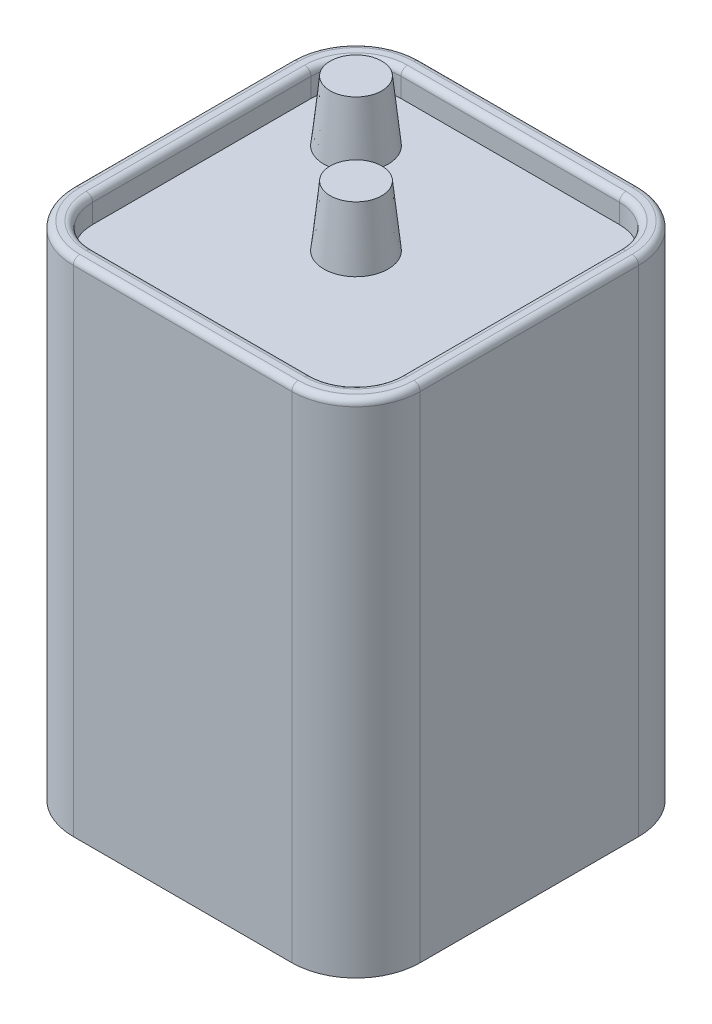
from build123d import *

# Parameters (mm, degrees)
SKETCH3_W                 = 68.58
SKETCH3_H                 = 68.58
BASE_EXTRUDE_DEPTH        = 99.06
SIDE_FILLETS_R            = 12.7
TOP_CUT_DEPTH             = 5.08
TOP_FACE_FILLET_R         = 1.27
SKETCH_TERMINALS_R        = 6.35
TERMINALS_DEPTH           = 11.938
TERMINALS_DRAFT           = 6
TERMINALS_PROFILE_2_DEPTH = 11.938
TERMINALS_PROFILE_2_DRAFT = 6


with BuildPart() as part:
    # Sketch3 → Base Extrude (new body)
    with BuildSketch(Plane(origin=(0, 0, 0), x_dir=(1, 0, 0), z_dir=(0, 1, 0))):
        Rectangle(SKETCH3_W, SKETCH3_H)
    extrude(amount=BASE_EXTRUDE_DEPTH)

    # Side Fillets
    side_fillets_edges = [part.edges().sort_by_distance(p)[0] for p in [
        (34.29, 49.53, 34.29),
        (-34.29, 49.53, 34.29),
        (-34.29, 49.53, -34.29),
        (34.29, 49.53, -34.29),
    ]]
    fillet(side_fillets_edges, radius=SIDE_FILLETS_R)

    # Sketch4 → Top Cut (cut)
    with BuildSketch(Plane(origin=(0, 99.06, 0), x_dir=(1, 0, 0), z_dir=(0, 1, 0))):
        with BuildLine():
            Line((21.59, 30.48), (-21.59, 30.48))
            ThreePointArc((-21.59, 30.48), (-27.876179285, 27.876179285), (-30.48, 21.59))
            Line((-30.48, 21.59), (-30.48, -21.59))
            ThreePointArc((-30.48, -21.59), (-27.876179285, -27.876179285), (-21.59, -30.48))
            Line((-21.59, -30.48), (21.59, -30.48))
            ThreePointArc((21.59, -30.48), (27.876179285, -27.876179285), (30.48, -21.59))
            Line((30.48, -21.59), (30.48, 21.59))
            ThreePointArc((30.48, 21.59), (27.876179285, 27.876179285), (21.59, 30.48))
        make_face()
    extrude(amount=-TOP_CUT_DEPTH, mode=Mode.SUBTRACT)

    # Top Face Fillet
    top_face_fillet_edges = [part.edges().sort_by_distance(p)[0] for p in [
        (-34.29, 99.06, 0),
        (0, 99.06, -34.29),
        (34.29, 99.06, 0),
        (0, 99.06, 34.29),
        (-30.570256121, 99.06, 30.570256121),
        (30.570256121, 99.06, -30.570256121),
        (30.570256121, 99.06, 30.570256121),
        (-30.570256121, 99.06, -30.570256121),
        (27.876179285, 99.06, -27.876179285),
        (0, 99.06, -30.48),
        (-27.876179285, 99.06, -27.876179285),
        (-30.48, 99.06, 0),
        (-27.876179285, 99.06, 27.876179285),
        (0, 99.06, 30.48),
        (27.876179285, 99.06, 27.876179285),
        (30.48, 99.06, 0),
    ]]
    fillet(top_face_fillet_edges, radius=TOP_FACE_FILLET_R)


with BuildPart() as terminals_tool:
    # Sketch-Terminals → Terminals (with draft: the straight prism first)
    with BuildSketch(Plane(origin=(0, 93.98, 0), x_dir=(1, 0, 0), z_dir=(0, 1, 0))):
        Circle(SKETCH_TERMINALS_R)
    extrude(amount=TERMINALS_DEPTH)
    # Terminals: the draft: its side faces are tilted about the plane it starts from
    terminals_sides = [terminals_tool.faces().sort_by_distance(p)[0] for p in [
        (-6.35, 99.949, 0),
    ]]
    draft(terminals_sides, Plane(origin=(0, 93.98, 0), x_dir=(1, 0, 0), z_dir=(0, 1, 0)), TERMINALS_DRAFT)


with BuildPart() as part_1:
    add(part.part)

    # Terminals: add terminals_tool
    add(terminals_tool.part)


with BuildPart() as terminals_profile_2_tool:
    # Sketch-Terminals → Terminals profile 2 (with draft: the straight prism first)
    with BuildSketch(Plane(origin=(0, 93.98, 0), x_dir=(1, 0, 0), z_dir=(0, 1, 0))):
        with Locations((-17.960512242, 17.960512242)):
            Circle(SKETCH_TERMINALS_R)
    extrude(amount=TERMINALS_PROFILE_2_DEPTH)
    # Terminals profile 2: the draft: its side faces are tilted about the plane it starts from
    terminals_profile_2_sides = [terminals_profile_2_tool.faces().sort_by_distance(p)[0] for p in [
        (-24.310512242, 99.949, -17.960512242),
    ]]
    draft(terminals_profile_2_sides, Plane(origin=(0, 93.98, 0), x_dir=(1, 0, 0), z_dir=(0, 1, 0)), TERMINALS_PROFILE_2_DRAFT)


with BuildPart() as part_2:
    add(part_1.part)

    # Terminals profile 2: add terminals_profile_2_tool
    add(terminals_profile_2_tool.part)


solid = part_2.part
